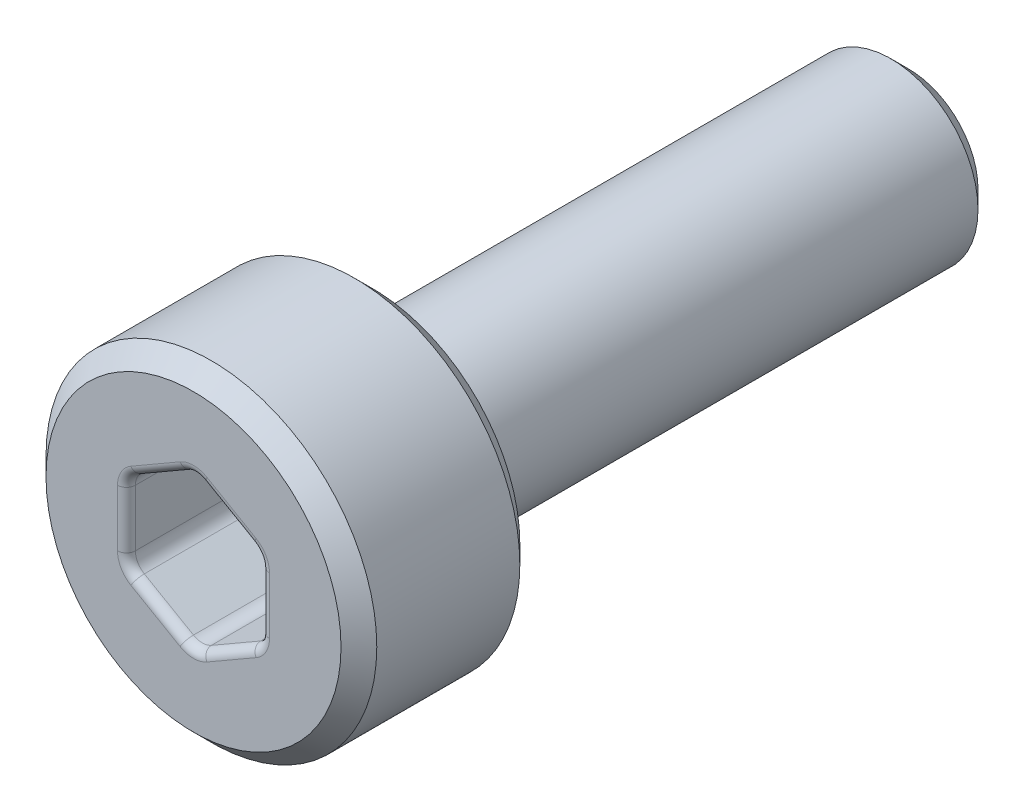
ISO-10303-21;
HEADER;
FILE_DESCRIPTION(('STEP AP214'),'2;1');
FILE_NAME('part.step','',(''),(''),'','','');
FILE_SCHEMA(('AUTOMOTIVE_DESIGN { 1 0 10303 214 1 1 1 1 }'));
ENDSEC;
DATA;
#1=APPLICATION_CONTEXT('core data for automotive mechanical design processes');
#2=APPLICATION_PROTOCOL_DEFINITION('international standard','automotive_design',2000,#1);
#3=PRODUCT_CONTEXT('',#1,'mechanical');
#4=PRODUCT('Part','Part','',(#3));
#5=PRODUCT_RELATED_PRODUCT_CATEGORY('part','',(#4));
#6=PRODUCT_DEFINITION_FORMATION('','',#4);
#7=PRODUCT_DEFINITION_CONTEXT('part definition',#1,'design');
#8=PRODUCT_DEFINITION('design','',#6,#7);
#9=PRODUCT_DEFINITION_SHAPE('','',#8);
#10=(LENGTH_UNIT() NAMED_UNIT(*) SI_UNIT(.MILLI.,.METRE.));
#11=(NAMED_UNIT(*) PLANE_ANGLE_UNIT() SI_UNIT($,.RADIAN.));
#12=(NAMED_UNIT(*) SI_UNIT($,.STERADIAN.) SOLID_ANGLE_UNIT());
#13=UNCERTAINTY_MEASURE_WITH_UNIT(LENGTH_MEASURE(1.E-05),#10,'distance_accuracy_value','');
#14=(GEOMETRIC_REPRESENTATION_CONTEXT(3) GLOBAL_UNCERTAINTY_ASSIGNED_CONTEXT((#13)) GLOBAL_UNIT_ASSIGNED_CONTEXT((#10,
#11,#12)) REPRESENTATION_CONTEXT('',''));
#15=CARTESIAN_POINT('',(0.,0.,0.));
#16=DIRECTION('',(0.,0.,1.));
#17=DIRECTION('',(1.,0.,0.));
#18=AXIS2_PLACEMENT_3D('',#15,#16,#17);
#19=CARTESIAN_POINT('',(0.,0.,2.));
#20=DIRECTION('',(0.,0.,-1.));
#21=DIRECTION('',(-1.,0.,0.));
#22=AXIS2_PLACEMENT_3D('',#19,#20,#21);
#23=PLANE('',#22);
#24=DIRECTION('',(0.,1.,0.));
#25=VECTOR('',#24,1.);
#26=CARTESIAN_POINT('',(0.85,0.,2.));
#27=LINE('',#26,#25);
#28=CARTESIAN_POINT('',(0.85,0.317542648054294,2.));
#29=VERTEX_POINT('',#28);
#30=CARTESIAN_POINT('',(0.85,-0.317542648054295,2.));
#31=VERTEX_POINT('',#30);
#32=EDGE_CURVE('E264',#29,#31,#27,.F.);
#33=ORIENTED_EDGE('',*,*,#32,.T.);
#34=CARTESIAN_POINT('',(0.55,-0.317542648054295,2.));
#35=DIRECTION('',(0.,0.,-1.));
#36=DIRECTION('',(-1.,0.,0.));
#37=AXIS2_PLACEMENT_3D('',#34,#35,#36);
#38=CIRCLE('',#37,0.3);
#39=CARTESIAN_POINT('',(0.699999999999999,-0.577350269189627,2.));
#40=VERTEX_POINT('',#39);
#41=EDGE_CURVE('E329',#31,#40,#38,.T.);
#42=ORIENTED_EDGE('',*,*,#41,.T.);
#43=DIRECTION('',(0.866025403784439,0.499999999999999,0.));
#44=VECTOR('',#43,1.);
#45=CARTESIAN_POINT('',(0.424999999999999,-0.736121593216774,2.));
#46=LINE('',#45,#44);
#47=CARTESIAN_POINT('',(0.149999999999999,-0.89489291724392,2.));
#48=VERTEX_POINT('',#47);
#49=EDGE_CURVE('E327',#40,#48,#46,.F.);
#50=ORIENTED_EDGE('',*,*,#49,.T.);
#51=CARTESIAN_POINT('',(0.,-0.635085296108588,2.));
#52=DIRECTION('',(0.,0.,-1.));
#53=DIRECTION('',(-1.,0.,0.));
#54=AXIS2_PLACEMENT_3D('',#51,#52,#53);
#55=CIRCLE('',#54,0.3);
#56=CARTESIAN_POINT('',(-0.150000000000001,-0.89489291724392,2.));
#57=VERTEX_POINT('',#56);
#58=EDGE_CURVE('E325',#48,#57,#55,.T.);
#59=ORIENTED_EDGE('',*,*,#58,.T.);
#60=DIRECTION('',(0.866025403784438,-0.500000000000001,0.));
#61=VECTOR('',#60,1.);
#62=CARTESIAN_POINT('',(-0.425000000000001,-0.736121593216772,2.));
#63=LINE('',#62,#61);
#64=CARTESIAN_POINT('',(-0.700000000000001,-0.577350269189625,2.));
#65=VERTEX_POINT('',#64);
#66=EDGE_CURVE('E323',#57,#65,#63,.F.);
#67=ORIENTED_EDGE('',*,*,#66,.T.);
#68=CARTESIAN_POINT('',(-0.550000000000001,-0.317542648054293,2.));
#69=DIRECTION('',(0.,0.,-1.));
#70=DIRECTION('',(-1.,0.,0.));
#71=AXIS2_PLACEMENT_3D('',#68,#69,#70);
#72=CIRCLE('',#71,0.3);
#73=CARTESIAN_POINT('',(-0.850000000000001,-0.317542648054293,2.));
#74=VERTEX_POINT('',#73);
#75=EDGE_CURVE('E321',#65,#74,#72,.T.);
#76=ORIENTED_EDGE('',*,*,#75,.T.);
#77=DIRECTION('',(0.,-1.,0.));
#78=VECTOR('',#77,1.);
#79=CARTESIAN_POINT('',(-0.85,0.,2.));
#80=LINE('',#79,#78);
#81=CARTESIAN_POINT('',(-0.85,0.317542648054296,2.));
#82=VERTEX_POINT('',#81);
#83=EDGE_CURVE('E319',#74,#82,#80,.F.);
#84=ORIENTED_EDGE('',*,*,#83,.T.);
#85=CARTESIAN_POINT('',(-0.55,0.317542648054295,2.));
#86=DIRECTION('',(0.,0.,-1.));
#87=DIRECTION('',(-1.,0.,0.));
#88=AXIS2_PLACEMENT_3D('',#85,#86,#87);
#89=CIRCLE('',#88,0.3);
#90=CARTESIAN_POINT('',(-0.699999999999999,0.577350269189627,2.));
#91=VERTEX_POINT('',#90);
#92=EDGE_CURVE('E317',#82,#91,#89,.T.);
#93=ORIENTED_EDGE('',*,*,#92,.T.);
#94=DIRECTION('',(-0.866025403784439,-0.499999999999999,0.));
#95=VECTOR('',#94,1.);
#96=CARTESIAN_POINT('',(-0.424999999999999,0.736121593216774,2.));
#97=LINE('',#96,#95);
#98=CARTESIAN_POINT('',(-0.149999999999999,0.894892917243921,2.));
#99=VERTEX_POINT('',#98);
#100=EDGE_CURVE('E315',#91,#99,#97,.F.);
#101=ORIENTED_EDGE('',*,*,#100,.T.);
#102=CARTESIAN_POINT('',(0.,0.635085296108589,2.));
#103=DIRECTION('',(0.,0.,-1.));
#104=DIRECTION('',(-1.,0.,0.));
#105=AXIS2_PLACEMENT_3D('',#102,#103,#104);
#106=CIRCLE('',#105,0.3);
#107=CARTESIAN_POINT('',(0.150000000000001,0.89489291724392,2.));
#108=VERTEX_POINT('',#107);
#109=EDGE_CURVE('E313',#99,#108,#106,.T.);
#110=ORIENTED_EDGE('',*,*,#109,.T.);
#111=DIRECTION('',(-0.866025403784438,0.500000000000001,0.));
#112=VECTOR('',#111,1.);
#113=CARTESIAN_POINT('',(0.425000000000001,0.736121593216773,2.));
#114=LINE('',#113,#112);
#115=CARTESIAN_POINT('',(0.700000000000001,0.577350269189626,2.));
#116=VERTEX_POINT('',#115);
#117=EDGE_CURVE('E311',#108,#116,#114,.F.);
#118=ORIENTED_EDGE('',*,*,#117,.T.);
#119=CARTESIAN_POINT('',(0.55,0.317542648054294,2.));
#120=DIRECTION('',(0.,0.,-1.));
#121=DIRECTION('',(-1.,0.,0.));
#122=AXIS2_PLACEMENT_3D('',#119,#120,#121);
#123=CIRCLE('',#122,0.3);
#124=EDGE_CURVE('E309',#116,#29,#123,.T.);
#125=ORIENTED_EDGE('',*,*,#124,.T.);
#126=EDGE_LOOP('',(#33,#42,#50,#59,#67,#76,#84,#93,#101,#110,#118,#125));
#127=FACE_BOUND('',#126,.T.);
#128=CARTESIAN_POINT('',(0.,0.,2.));
#129=DIRECTION('',(0.,0.,-1.));
#130=DIRECTION('',(-1.,0.,0.));
#131=AXIS2_PLACEMENT_3D('',#128,#129,#130);
#132=CIRCLE('',#131,1.65);
#133=CARTESIAN_POINT('',(-1.65,0.,2.));
#134=VERTEX_POINT('',#133);
#135=EDGE_CURVE('E307',#134,#134,#132,.F.);
#136=ORIENTED_EDGE('',*,*,#135,.T.);
#137=EDGE_LOOP('',(#136));
#138=FACE_BOUND('',#137,.T.);
#139=ADVANCED_FACE('F35',(#127,#138),#23,.F.);
#140=CARTESIAN_POINT('',(0.,0.,21.9198795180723));
#141=DIRECTION('',(0.,0.,1.));
#142=DIRECTION('',(1.,0.,0.));
#143=AXIS2_PLACEMENT_3D('',#140,#141,#142);
#144=CYLINDRICAL_SURFACE('',#143,1.85);
#145=CARTESIAN_POINT('',(0.,0.,1.8));
#146=DIRECTION('',(0.,0.,-1.));
#147=DIRECTION('',(-1.,0.,0.));
#148=AXIS2_PLACEMENT_3D('',#145,#146,#147);
#149=CIRCLE('',#148,1.85);
#150=CARTESIAN_POINT('',(-1.85,0.,1.8));
#151=VERTEX_POINT('',#150);
#152=EDGE_CURVE('E869',#151,#151,#149,.T.);
#153=ORIENTED_EDGE('',*,*,#152,.T.);
#154=EDGE_LOOP('',(#153));
#155=FACE_BOUND('',#154,.T.);
#156=CARTESIAN_POINT('',(0.,0.,0.200000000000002));
#157=DIRECTION('',(0.,0.,1.));
#158=DIRECTION('',(1.,0.,0.));
#159=AXIS2_PLACEMENT_3D('',#156,#157,#158);
#160=CIRCLE('',#159,1.85);
#161=CARTESIAN_POINT('',(1.85,0.,0.200000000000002));
#162=VERTEX_POINT('',#161);
#163=EDGE_CURVE('E874',#162,#162,#160,.T.);
#164=ORIENTED_EDGE('',*,*,#163,.T.);
#165=EDGE_LOOP('',(#164));
#166=FACE_BOUND('',#165,.T.);
#167=ADVANCED_FACE('F428',(#155,#166),#144,.T.);
#168=CARTESIAN_POINT('',(0.,1.85,0.));
#169=DIRECTION('',(0.,0.,1.));
#170=DIRECTION('',(1.,0.,0.));
#171=AXIS2_PLACEMENT_3D('',#168,#169,#170);
#172=PLANE('',#171);
#173=CARTESIAN_POINT('',(0.,0.,0.));
#174=DIRECTION('',(0.,0.,1.));
#175=DIRECTION('',(1.,0.,0.));
#176=AXIS2_PLACEMENT_3D('',#173,#174,#175);
#177=CIRCLE('',#176,1.175);
#178=CARTESIAN_POINT('',(1.175,0.,0.));
#179=VERTEX_POINT('',#178);
#180=EDGE_CURVE('E259',#179,#179,#177,.T.);
#181=ORIENTED_EDGE('',*,*,#180,.T.);
#182=EDGE_LOOP('',(#181));
#183=FACE_BOUND('',#182,.T.);
#184=CARTESIAN_POINT('',(0.,0.,0.));
#185=DIRECTION('',(0.,0.,1.));
#186=DIRECTION('',(1.,0.,0.));
#187=AXIS2_PLACEMENT_3D('',#184,#185,#186);
#188=CIRCLE('',#187,1.65);
#189=CARTESIAN_POINT('',(1.65,0.,0.));
#190=VERTEX_POINT('',#189);
#191=EDGE_CURVE('E867',#190,#190,#188,.F.);
#192=ORIENTED_EDGE('',*,*,#191,.T.);
#193=EDGE_LOOP('',(#192));
#194=FACE_BOUND('',#193,.T.);
#195=ADVANCED_FACE('F434',(#183,#194),#172,.F.);
#196=CARTESIAN_POINT('',(0.,0.,21.9198795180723));
#197=DIRECTION('',(0.,0.,1.));
#198=DIRECTION('',(1.,0.,0.));
#199=AXIS2_PLACEMENT_3D('',#196,#197,#198);
#200=CYLINDRICAL_SURFACE('',#199,0.975);
#201=CARTESIAN_POINT('',(0.,0.,-0.200000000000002));
#202=DIRECTION('',(0.,0.,1.));
#203=DIRECTION('',(1.,0.,0.));
#204=AXIS2_PLACEMENT_3D('',#201,#202,#203);
#205=CIRCLE('',#204,0.975);
#206=CARTESIAN_POINT('',(0.975,0.,-0.200000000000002));
#207=VERTEX_POINT('',#206);
#208=EDGE_CURVE('E262',#207,#207,#205,.F.);
#209=ORIENTED_EDGE('',*,*,#208,.T.);
#210=EDGE_LOOP('',(#209));
#211=FACE_BOUND('',#210,.T.);
#212=CARTESIAN_POINT('',(0.,0.,-5.80000000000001));
#213=DIRECTION('',(0.,0.,1.));
#214=DIRECTION('',(1.,0.,0.));
#215=AXIS2_PLACEMENT_3D('',#212,#213,#214);
#216=CIRCLE('',#215,0.975);
#217=CARTESIAN_POINT('',(0.975,0.,-5.80000000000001));
#218=VERTEX_POINT('',#217);
#219=EDGE_CURVE('E868',#218,#218,#216,.T.);
#220=ORIENTED_EDGE('',*,*,#219,.T.);
#221=EDGE_LOOP('',(#220));
#222=FACE_BOUND('',#221,.T.);
#223=ADVANCED_FACE('F809',(#211,#222),#200,.T.);
#224=CARTESIAN_POINT('',(0.,0.975,-6.));
#225=DIRECTION('',(0.,0.,1.));
#226=DIRECTION('',(1.,0.,0.));
#227=AXIS2_PLACEMENT_3D('',#224,#225,#226);
#228=PLANE('',#227);
#229=CARTESIAN_POINT('',(0.,0.,-6.));
#230=DIRECTION('',(0.,0.,1.));
#231=DIRECTION('',(1.,0.,0.));
#232=AXIS2_PLACEMENT_3D('',#229,#230,#231);
#233=CIRCLE('',#232,0.775000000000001);
#234=CARTESIAN_POINT('',(0.775000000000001,0.,-6.));
#235=VERTEX_POINT('',#234);
#236=EDGE_CURVE('E209',#235,#235,#233,.F.);
#237=ORIENTED_EDGE('',*,*,#236,.T.);
#238=EDGE_LOOP('',(#237));
#239=FACE_BOUND('',#238,.T.);
#240=ADVANCED_FACE('F801',(#239),#228,.F.);
#241=CARTESIAN_POINT('',(0.,-0.866025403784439,0.499999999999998));
#242=DIRECTION('',(0.499999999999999,-0.866025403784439,0.));
#243=DIRECTION('',(0.866025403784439,0.499999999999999,0.));
#244=AXIS2_PLACEMENT_3D('',#241,#242,#243);
#245=PLANE('',#244);
#246=DIRECTION('',(0.,0.,1.));
#247=VECTOR('',#246,1.);
#248=CARTESIAN_POINT('',(0.0999999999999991,-0.808290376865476,2.));
#249=LINE('',#248,#247);
#250=CARTESIAN_POINT('',(0.0999999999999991,-0.808290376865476,0.699999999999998));
#251=VERTEX_POINT('',#250);
#252=CARTESIAN_POINT('',(0.0999999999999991,-0.808290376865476,1.9));
#253=VERTEX_POINT('',#252);
#254=EDGE_CURVE('E256',#251,#253,#249,.T.);
#255=ORIENTED_EDGE('',*,*,#254,.T.);
#256=DIRECTION('',(0.866025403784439,0.499999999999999,0.));
#257=VECTOR('',#256,1.);
#258=CARTESIAN_POINT('',(0.,-0.866025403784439,1.9));
#259=LINE('',#258,#257);
#260=CARTESIAN_POINT('',(0.649999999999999,-0.490747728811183,1.9));
#261=VERTEX_POINT('',#260);
#262=EDGE_CURVE('E335',#253,#261,#259,.T.);
#263=ORIENTED_EDGE('',*,*,#262,.T.);
#264=DIRECTION('',(0.,0.,1.));
#265=VECTOR('',#264,1.);
#266=CARTESIAN_POINT('',(0.649999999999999,-0.490747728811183,0.499999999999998));
#267=LINE('',#266,#265);
#268=CARTESIAN_POINT('',(0.649999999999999,-0.490747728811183,0.699999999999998));
#269=VERTEX_POINT('',#268);
#270=EDGE_CURVE('E252',#261,#269,#267,.F.);
#271=ORIENTED_EDGE('',*,*,#270,.T.);
#272=DIRECTION('',(0.866025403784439,0.499999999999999,0.));
#273=VECTOR('',#272,1.);
#274=CARTESIAN_POINT('',(0.,-0.866025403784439,0.699999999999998));
#275=LINE('',#274,#273);
#276=EDGE_CURVE('E254',#269,#251,#275,.F.);
#277=ORIENTED_EDGE('',*,*,#276,.T.);
#278=EDGE_LOOP('',(#255,#263,#271,#277));
#279=FACE_BOUND('',#278,.T.);
#280=ADVANCED_FACE('F792',(#279),#245,.F.);
#281=CARTESIAN_POINT('',(-0.750000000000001,-0.433012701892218,0.499999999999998));
#282=DIRECTION('',(-0.500000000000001,-0.866025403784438,0.));
#283=DIRECTION('',(0.866025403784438,-0.500000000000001,0.));
#284=AXIS2_PLACEMENT_3D('',#281,#282,#283);
#285=PLANE('',#284);
#286=DIRECTION('',(0.,0.,1.));
#287=VECTOR('',#286,1.);
#288=CARTESIAN_POINT('',(-0.650000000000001,-0.490747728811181,2.));
#289=LINE('',#288,#287);
#290=CARTESIAN_POINT('',(-0.650000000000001,-0.490747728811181,0.699999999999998));
#291=VERTEX_POINT('',#290);
#292=CARTESIAN_POINT('',(-0.650000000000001,-0.490747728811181,1.9));
#293=VERTEX_POINT('',#292);
#294=EDGE_CURVE('E223',#291,#293,#289,.T.);
#295=ORIENTED_EDGE('',*,*,#294,.T.);
#296=DIRECTION('',(0.866025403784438,-0.500000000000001,0.));
#297=VECTOR('',#296,1.);
#298=CARTESIAN_POINT('',(-0.750000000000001,-0.433012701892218,1.9));
#299=LINE('',#298,#297);
#300=CARTESIAN_POINT('',(-0.100000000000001,-0.808290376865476,1.9));
#301=VERTEX_POINT('',#300);
#302=EDGE_CURVE('E339',#293,#301,#299,.T.);
#303=ORIENTED_EDGE('',*,*,#302,.T.);
#304=DIRECTION('',(0.,0.,1.));
#305=VECTOR('',#304,1.);
#306=CARTESIAN_POINT('',(-0.100000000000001,-0.808290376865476,0.499999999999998));
#307=LINE('',#306,#305);
#308=CARTESIAN_POINT('',(-0.100000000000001,-0.808290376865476,0.699999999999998));
#309=VERTEX_POINT('',#308);
#310=EDGE_CURVE('E215',#301,#309,#307,.F.);
#311=ORIENTED_EDGE('',*,*,#310,.T.);
#312=DIRECTION('',(0.866025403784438,-0.500000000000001,0.));
#313=VECTOR('',#312,1.);
#314=CARTESIAN_POINT('',(-0.750000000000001,-0.433012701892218,0.699999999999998));
#315=LINE('',#314,#313);
#316=EDGE_CURVE('E186',#309,#291,#315,.F.);
#317=ORIENTED_EDGE('',*,*,#316,.T.);
#318=EDGE_LOOP('',(#295,#303,#311,#317));
#319=FACE_BOUND('',#318,.T.);
#320=ADVANCED_FACE('F784',(#319),#285,.F.);
#321=CARTESIAN_POINT('',(-0.75,0.433012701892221,0.499999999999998));
#322=DIRECTION('',(-1.,0.,0.));
#323=DIRECTION('',(0.,-1.,0.));
#324=AXIS2_PLACEMENT_3D('',#321,#322,#323);
#325=PLANE('',#324);
#326=DIRECTION('',(0.,0.,1.));
#327=VECTOR('',#326,1.);
#328=CARTESIAN_POINT('',(-0.75,0.317542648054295,2.));
#329=LINE('',#328,#327);
#330=CARTESIAN_POINT('',(-0.75,0.317542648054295,0.699999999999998));
#331=VERTEX_POINT('',#330);
#332=CARTESIAN_POINT('',(-0.75,0.317542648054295,1.9));
#333=VERTEX_POINT('',#332);
#334=EDGE_CURVE('E226',#331,#333,#329,.T.);
#335=ORIENTED_EDGE('',*,*,#334,.T.);
#336=DIRECTION('',(0.,-1.,0.));
#337=VECTOR('',#336,1.);
#338=CARTESIAN_POINT('',(-0.75,0.433012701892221,1.9));
#339=LINE('',#338,#337);
#340=CARTESIAN_POINT('',(-0.750000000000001,-0.317542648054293,1.9));
#341=VERTEX_POINT('',#340);
#342=EDGE_CURVE('E343',#333,#341,#339,.T.);
#343=ORIENTED_EDGE('',*,*,#342,.T.);
#344=DIRECTION('',(0.,0.,1.));
#345=VECTOR('',#344,1.);
#346=CARTESIAN_POINT('',(-0.750000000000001,-0.317542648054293,0.499999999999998));
#347=LINE('',#346,#345);
#348=CARTESIAN_POINT('',(-0.750000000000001,-0.317542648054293,0.699999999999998));
#349=VERTEX_POINT('',#348);
#350=EDGE_CURVE('E231',#341,#349,#347,.F.);
#351=ORIENTED_EDGE('',*,*,#350,.T.);
#352=DIRECTION('',(0.,-1.,0.));
#353=VECTOR('',#352,1.);
#354=CARTESIAN_POINT('',(-0.75,0.433012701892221,0.699999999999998));
#355=LINE('',#354,#353);
#356=EDGE_CURVE('E229',#349,#331,#355,.F.);
#357=ORIENTED_EDGE('',*,*,#356,.T.);
#358=EDGE_LOOP('',(#335,#343,#351,#357));
#359=FACE_BOUND('',#358,.T.);
#360=ADVANCED_FACE('F403',(#359),#325,.F.);
#361=CARTESIAN_POINT('',(0.,0.866025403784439,0.499999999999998));
#362=DIRECTION('',(-0.499999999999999,0.866025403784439,0.));
#363=DIRECTION('',(-0.866025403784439,-0.499999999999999,0.));
#364=AXIS2_PLACEMENT_3D('',#361,#362,#363);
#365=PLANE('',#364);
#366=DIRECTION('',(0.,0.,1.));
#367=VECTOR('',#366,1.);
#368=CARTESIAN_POINT('',(-0.0999999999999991,0.808290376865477,2.));
#369=LINE('',#368,#367);
#370=CARTESIAN_POINT('',(-0.0999999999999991,0.808290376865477,0.699999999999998));
#371=VERTEX_POINT('',#370);
#372=CARTESIAN_POINT('',(-0.0999999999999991,0.808290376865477,1.9));
#373=VERTEX_POINT('',#372);
#374=EDGE_CURVE('E237',#371,#373,#369,.T.);
#375=ORIENTED_EDGE('',*,*,#374,.T.);
#376=DIRECTION('',(-0.866025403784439,-0.499999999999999,0.));
#377=VECTOR('',#376,1.);
#378=CARTESIAN_POINT('',(0.,0.866025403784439,1.9));
#379=LINE('',#378,#377);
#380=CARTESIAN_POINT('',(-0.65,0.490747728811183,1.9));
#381=VERTEX_POINT('',#380);
#382=EDGE_CURVE('E347',#373,#381,#379,.T.);
#383=ORIENTED_EDGE('',*,*,#382,.T.);
#384=DIRECTION('',(0.,0.,1.));
#385=VECTOR('',#384,1.);
#386=CARTESIAN_POINT('',(-0.65,0.490747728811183,0.499999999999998));
#387=LINE('',#386,#385);
#388=CARTESIAN_POINT('',(-0.65,0.490747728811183,0.699999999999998));
#389=VERTEX_POINT('',#388);
#390=EDGE_CURVE('E233',#381,#389,#387,.F.);
#391=ORIENTED_EDGE('',*,*,#390,.T.);
#392=DIRECTION('',(-0.866025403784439,-0.499999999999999,0.));
#393=VECTOR('',#392,1.);
#394=CARTESIAN_POINT('',(0.,0.866025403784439,0.699999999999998));
#395=LINE('',#394,#393);
#396=EDGE_CURVE('E235',#389,#371,#395,.F.);
#397=ORIENTED_EDGE('',*,*,#396,.T.);
#398=EDGE_LOOP('',(#375,#383,#391,#397));
#399=FACE_BOUND('',#398,.T.);
#400=ADVANCED_FACE('F767',(#399),#365,.F.);
#401=CARTESIAN_POINT('',(0.75,0.433012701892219,0.499999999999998));
#402=DIRECTION('',(0.500000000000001,0.866025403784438,0.));
#403=DIRECTION('',(-0.866025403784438,0.500000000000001,0.));
#404=AXIS2_PLACEMENT_3D('',#401,#402,#403);
#405=PLANE('',#404);
#406=DIRECTION('',(0.,0.,1.));
#407=VECTOR('',#406,1.);
#408=CARTESIAN_POINT('',(0.65,0.490747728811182,2.));
#409=LINE('',#408,#407);
#410=CARTESIAN_POINT('',(0.65,0.490747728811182,0.699999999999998));
#411=VERTEX_POINT('',#410);
#412=CARTESIAN_POINT('',(0.65,0.490747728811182,1.9));
#413=VERTEX_POINT('',#412);
#414=EDGE_CURVE('E244',#411,#413,#409,.T.);
#415=ORIENTED_EDGE('',*,*,#414,.T.);
#416=DIRECTION('',(-0.866025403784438,0.500000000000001,0.));
#417=VECTOR('',#416,1.);
#418=CARTESIAN_POINT('',(0.75,0.433012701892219,1.9));
#419=LINE('',#418,#417);
#420=CARTESIAN_POINT('',(0.100000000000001,0.808290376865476,1.9));
#421=VERTEX_POINT('',#420);
#422=EDGE_CURVE('E351',#413,#421,#419,.T.);
#423=ORIENTED_EDGE('',*,*,#422,.T.);
#424=DIRECTION('',(0.,0.,1.));
#425=VECTOR('',#424,1.);
#426=CARTESIAN_POINT('',(0.100000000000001,0.808290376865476,0.499999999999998));
#427=LINE('',#426,#425);
#428=CARTESIAN_POINT('',(0.100000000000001,0.808290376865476,0.699999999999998));
#429=VERTEX_POINT('',#428);
#430=EDGE_CURVE('E240',#421,#429,#427,.F.);
#431=ORIENTED_EDGE('',*,*,#430,.T.);
#432=DIRECTION('',(-0.866025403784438,0.500000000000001,0.));
#433=VECTOR('',#432,1.);
#434=CARTESIAN_POINT('',(0.75,0.433012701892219,0.699999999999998));
#435=LINE('',#434,#433);
#436=EDGE_CURVE('E242',#429,#411,#435,.F.);
#437=ORIENTED_EDGE('',*,*,#436,.T.);
#438=EDGE_LOOP('',(#415,#423,#431,#437));
#439=FACE_BOUND('',#438,.T.);
#440=ADVANCED_FACE('F759',(#439),#405,.F.);
#441=CARTESIAN_POINT('',(0.75,-0.433012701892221,0.499999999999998));
#442=DIRECTION('',(1.,0.,0.));
#443=DIRECTION('',(0.,1.,0.));
#444=AXIS2_PLACEMENT_3D('',#441,#442,#443);
#445=PLANE('',#444);
#446=DIRECTION('',(0.,0.,1.));
#447=VECTOR('',#446,1.);
#448=CARTESIAN_POINT('',(0.75,-0.317542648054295,2.));
#449=LINE('',#448,#447);
#450=CARTESIAN_POINT('',(0.75,-0.317542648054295,0.699999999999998));
#451=VERTEX_POINT('',#450);
#452=CARTESIAN_POINT('',(0.75,-0.317542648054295,1.9));
#453=VERTEX_POINT('',#452);
#454=EDGE_CURVE('E250',#451,#453,#449,.T.);
#455=ORIENTED_EDGE('',*,*,#454,.T.);
#456=DIRECTION('',(0.,1.,0.));
#457=VECTOR('',#456,1.);
#458=CARTESIAN_POINT('',(0.75,-0.433012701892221,1.9));
#459=LINE('',#458,#457);
#460=CARTESIAN_POINT('',(0.75,0.317542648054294,1.9));
#461=VERTEX_POINT('',#460);
#462=EDGE_CURVE('E11',#453,#461,#459,.T.);
#463=ORIENTED_EDGE('',*,*,#462,.T.);
#464=DIRECTION('',(0.,0.,1.));
#465=VECTOR('',#464,1.);
#466=CARTESIAN_POINT('',(0.75,0.317542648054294,0.499999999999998));
#467=LINE('',#466,#465);
#468=CARTESIAN_POINT('',(0.75,0.317542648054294,0.699999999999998));
#469=VERTEX_POINT('',#468);
#470=EDGE_CURVE('E246',#461,#469,#467,.F.);
#471=ORIENTED_EDGE('',*,*,#470,.T.);
#472=DIRECTION('',(0.,1.,0.));
#473=VECTOR('',#472,1.);
#474=CARTESIAN_POINT('',(0.75,-0.433012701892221,0.699999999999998));
#475=LINE('',#474,#473);
#476=EDGE_CURVE('E248',#469,#451,#475,.F.);
#477=ORIENTED_EDGE('',*,*,#476,.T.);
#478=EDGE_LOOP('',(#455,#463,#471,#477));
#479=FACE_BOUND('',#478,.T.);
#480=ADVANCED_FACE('F751',(#479),#445,.F.);
#481=CARTESIAN_POINT('',(0.,0.,0.499999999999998));
#482=DIRECTION('',(0.,0.,1.));
#483=DIRECTION('',(1.,0.,0.));
#484=AXIS2_PLACEMENT_3D('',#481,#482,#483);
#485=PLANE('',#484);
#486=DIRECTION('',(0.,-1.,0.));
#487=VECTOR('',#486,1.);
#488=CARTESIAN_POINT('',(-0.55,0.,0.499999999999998));
#489=LINE('',#488,#487);
#490=CARTESIAN_POINT('',(-0.55,0.317542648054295,0.499999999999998));
#491=VERTEX_POINT('',#490);
#492=CARTESIAN_POINT('',(-0.550000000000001,-0.317542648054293,0.499999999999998));
#493=VERTEX_POINT('',#492);
#494=EDGE_CURVE('E213',#491,#493,#489,.T.);
#495=ORIENTED_EDGE('',*,*,#494,.T.);
#496=DIRECTION('',(0.866025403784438,-0.500000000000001,0.));
#497=VECTOR('',#496,1.);
#498=CARTESIAN_POINT('',(-0.275000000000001,-0.476313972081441,0.499999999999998));
#499=LINE('',#498,#497);
#500=CARTESIAN_POINT('',(0.,-0.635085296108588,0.499999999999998));
#501=VERTEX_POINT('',#500);
#502=EDGE_CURVE('E184',#493,#501,#499,.T.);
#503=ORIENTED_EDGE('',*,*,#502,.T.);
#504=DIRECTION('',(0.866025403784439,0.499999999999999,0.));
#505=VECTOR('',#504,1.);
#506=CARTESIAN_POINT('',(0.274999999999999,-0.476313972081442,0.499999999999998));
#507=LINE('',#506,#505);
#508=CARTESIAN_POINT('',(0.55,-0.317542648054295,0.499999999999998));
#509=VERTEX_POINT('',#508);
#510=EDGE_CURVE('E202',#501,#509,#507,.T.);
#511=ORIENTED_EDGE('',*,*,#510,.T.);
#512=DIRECTION('',(0.,1.,0.));
#513=VECTOR('',#512,1.);
#514=CARTESIAN_POINT('',(0.55,0.,0.499999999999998));
#515=LINE('',#514,#513);
#516=CARTESIAN_POINT('',(0.55,0.317542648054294,0.499999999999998));
#517=VERTEX_POINT('',#516);
#518=EDGE_CURVE('E208',#509,#517,#515,.T.);
#519=ORIENTED_EDGE('',*,*,#518,.T.);
#520=DIRECTION('',(-0.866025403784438,0.500000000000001,0.));
#521=VECTOR('',#520,1.);
#522=CARTESIAN_POINT('',(0.275000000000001,0.476313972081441,0.499999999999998));
#523=LINE('',#522,#521);
#524=CARTESIAN_POINT('',(0.,0.635085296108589,0.499999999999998));
#525=VERTEX_POINT('',#524);
#526=EDGE_CURVE('E881',#517,#525,#523,.T.);
#527=ORIENTED_EDGE('',*,*,#526,.T.);
#528=DIRECTION('',(-0.866025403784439,-0.499999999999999,0.));
#529=VECTOR('',#528,1.);
#530=CARTESIAN_POINT('',(-0.275,0.476313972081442,0.499999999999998));
#531=LINE('',#530,#529);
#532=EDGE_CURVE('E218',#525,#491,#531,.T.);
#533=ORIENTED_EDGE('',*,*,#532,.T.);
#534=EDGE_LOOP('',(#495,#503,#511,#519,#527,#533));
#535=FACE_BOUND('',#534,.T.);
#536=ADVANCED_FACE('F211',(#535),#485,.T.);
#537=CARTESIAN_POINT('',(0.,0.,2.));
#538=DIRECTION('',(0.,0.,-1.));
#539=DIRECTION('',(-1.,0.,0.));
#540=AXIS2_PLACEMENT_3D('',#537,#538,#539);
#541=CONICAL_SURFACE('',#540,1.65,0.785398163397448);
#542=ORIENTED_EDGE('',*,*,#152,.F.);
#543=EDGE_LOOP('',(#542));
#544=FACE_BOUND('',#543,.T.);
#545=ORIENTED_EDGE('',*,*,#135,.F.);
#546=EDGE_LOOP('',(#545));
#547=FACE_BOUND('',#546,.T.);
#548=ADVANCED_FACE('F440',(#544,#547),#541,.T.);
#549=CARTESIAN_POINT('',(0.,0.,0.200000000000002));
#550=DIRECTION('',(0.,0.,1.));
#551=DIRECTION('',(1.,0.,0.));
#552=AXIS2_PLACEMENT_3D('',#549,#550,#551);
#553=CONICAL_SURFACE('',#552,1.85,0.78539816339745);
#554=ORIENTED_EDGE('',*,*,#191,.F.);
#555=EDGE_LOOP('',(#554));
#556=FACE_BOUND('',#555,.T.);
#557=ORIENTED_EDGE('',*,*,#163,.F.);
#558=EDGE_LOOP('',(#557));
#559=FACE_BOUND('',#558,.T.);
#560=ADVANCED_FACE('F443',(#556,#559),#553,.T.);
#561=CARTESIAN_POINT('',(0.,0.,-5.80000000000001));
#562=DIRECTION('',(0.,0.,1.));
#563=DIRECTION('',(1.,0.,0.));
#564=AXIS2_PLACEMENT_3D('',#561,#562,#563);
#565=CONICAL_SURFACE('',#564,0.975,0.785398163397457);
#566=ORIENTED_EDGE('',*,*,#236,.F.);
#567=EDGE_LOOP('',(#566));
#568=FACE_BOUND('',#567,.T.);
#569=ORIENTED_EDGE('',*,*,#219,.F.);
#570=EDGE_LOOP('',(#569));
#571=FACE_BOUND('',#570,.T.);
#572=ADVANCED_FACE('F447',(#568,#571),#565,.T.);
#573=CARTESIAN_POINT('',(0.,0.635085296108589,0.499999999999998));
#574=DIRECTION('',(0.,0.,-1.));
#575=DIRECTION('',(-1.,0.,0.));
#576=AXIS2_PLACEMENT_3D('',#573,#574,#575);
#577=CYLINDRICAL_SURFACE('',#576,0.2);
#578=ORIENTED_EDGE('',*,*,#430,.F.);
#579=CARTESIAN_POINT('',(0.,0.635085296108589,1.9));
#580=DIRECTION('',(0.,0.,-1.));
#581=DIRECTION('',(-1.,0.,0.));
#582=AXIS2_PLACEMENT_3D('',#579,#580,#581);
#583=CIRCLE('',#582,0.2);
#584=EDGE_CURVE('E349',#421,#373,#583,.F.);
#585=ORIENTED_EDGE('',*,*,#584,.T.);
#586=ORIENTED_EDGE('',*,*,#374,.F.);
#587=CARTESIAN_POINT('',(0.,0.635085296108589,0.699999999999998));
#588=DIRECTION('',(0.,0.,1.));
#589=DIRECTION('',(1.,0.,0.));
#590=AXIS2_PLACEMENT_3D('',#587,#588,#589);
#591=CIRCLE('',#590,0.2);
#592=EDGE_CURVE('E304',#429,#371,#591,.T.);
#593=ORIENTED_EDGE('',*,*,#592,.F.);
#594=EDGE_LOOP('',(#578,#585,#586,#593));
#595=FACE_BOUND('',#594,.T.);
#596=ADVANCED_FACE('F451',(#595),#577,.F.);
#597=CARTESIAN_POINT('',(0.275000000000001,0.476313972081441,0.699999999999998));
#598=DIRECTION('',(-0.866025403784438,0.500000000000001,0.));
#599=DIRECTION('',(-0.500000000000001,-0.866025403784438,0.));
#600=AXIS2_PLACEMENT_3D('',#597,#598,#599);
#601=CYLINDRICAL_SURFACE('',#600,0.2);
#602=CARTESIAN_POINT('',(0.55,0.317542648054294,0.699999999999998));
#603=DIRECTION('',(-0.866025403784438,0.500000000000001,0.));
#604=DIRECTION('',(-0.500000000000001,-0.866025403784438,0.));
#605=AXIS2_PLACEMENT_3D('',#602,#603,#604);
#606=CIRCLE('',#605,0.2);
#607=EDGE_CURVE('E298',#411,#517,#606,.T.);
#608=ORIENTED_EDGE('',*,*,#607,.F.);
#609=ORIENTED_EDGE('',*,*,#436,.F.);
#610=CARTESIAN_POINT('',(0.,0.635085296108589,0.699999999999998));
#611=DIRECTION('',(0.866025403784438,-0.500000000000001,0.));
#612=DIRECTION('',(0.500000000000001,0.866025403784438,0.));
#613=AXIS2_PLACEMENT_3D('',#610,#611,#612);
#614=CIRCLE('',#613,0.2);
#615=EDGE_CURVE('E301',#525,#429,#614,.T.);
#616=ORIENTED_EDGE('',*,*,#615,.F.);
#617=ORIENTED_EDGE('',*,*,#526,.F.);
#618=EDGE_LOOP('',(#608,#609,#616,#617));
#619=FACE_BOUND('',#618,.T.);
#620=ADVANCED_FACE('F712',(#619),#601,.F.);
#621=CARTESIAN_POINT('',(0.55,0.317542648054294,0.499999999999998));
#622=DIRECTION('',(0.,0.,-1.));
#623=DIRECTION('',(-1.,0.,0.));
#624=AXIS2_PLACEMENT_3D('',#621,#622,#623);
#625=CYLINDRICAL_SURFACE('',#624,0.2);
#626=ORIENTED_EDGE('',*,*,#470,.F.);
#627=CARTESIAN_POINT('',(0.55,0.317542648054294,1.9));
#628=DIRECTION('',(0.,0.,-1.));
#629=DIRECTION('',(-1.,0.,0.));
#630=AXIS2_PLACEMENT_3D('',#627,#628,#629);
#631=CIRCLE('',#630,0.2);
#632=EDGE_CURVE('E44',#461,#413,#631,.F.);
#633=ORIENTED_EDGE('',*,*,#632,.T.);
#634=ORIENTED_EDGE('',*,*,#414,.F.);
#635=CARTESIAN_POINT('',(0.55,0.317542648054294,0.699999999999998));
#636=DIRECTION('',(0.,0.,1.));
#637=DIRECTION('',(1.,0.,0.));
#638=AXIS2_PLACEMENT_3D('',#635,#636,#637);
#639=CIRCLE('',#638,0.2);
#640=EDGE_CURVE('E295',#469,#411,#639,.T.);
#641=ORIENTED_EDGE('',*,*,#640,.F.);
#642=EDGE_LOOP('',(#626,#633,#634,#641));
#643=FACE_BOUND('',#642,.T.);
#644=ADVANCED_FACE('F703',(#643),#625,.F.);
#645=CARTESIAN_POINT('',(0.,0.635085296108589,0.699999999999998));
#646=DIRECTION('',(0.,0.,1.));
#647=DIRECTION('',(1.,0.,0.));
#648=AXIS2_PLACEMENT_3D('',#645,#646,#647);
#649=SPHERICAL_SURFACE('',#648,0.2);
#650=ORIENTED_EDGE('',*,*,#615,.T.);
#651=ORIENTED_EDGE('',*,*,#592,.T.);
#652=CARTESIAN_POINT('',(0.,0.635085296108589,0.699999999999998));
#653=DIRECTION('',(-0.866025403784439,-0.499999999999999,0.));
#654=DIRECTION('',(0.499999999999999,-0.866025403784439,0.));
#655=AXIS2_PLACEMENT_3D('',#652,#653,#654);
#656=CIRCLE('',#655,0.2);
#657=EDGE_CURVE('E292',#525,#371,#656,.F.);
#658=ORIENTED_EDGE('',*,*,#657,.F.);
#659=EDGE_LOOP('',(#650,#651,#658));
#660=FACE_BOUND('',#659,.T.);
#661=ADVANCED_FACE('F694',(#660),#649,.F.);
#662=CARTESIAN_POINT('',(0.55,0.317542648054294,0.699999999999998));
#663=DIRECTION('',(0.,0.,1.));
#664=DIRECTION('',(1.,0.,0.));
#665=AXIS2_PLACEMENT_3D('',#662,#663,#664);
#666=SPHERICAL_SURFACE('',#665,0.2);
#667=ORIENTED_EDGE('',*,*,#640,.T.);
#668=ORIENTED_EDGE('',*,*,#607,.T.);
#669=CARTESIAN_POINT('',(0.55,0.317542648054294,0.699999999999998));
#670=DIRECTION('',(0.,-1.,0.));
#671=DIRECTION('',(1.,0.,0.));
#672=AXIS2_PLACEMENT_3D('',#669,#670,#671);
#673=CIRCLE('',#672,0.2);
#674=EDGE_CURVE('E289',#469,#517,#673,.F.);
#675=ORIENTED_EDGE('',*,*,#674,.F.);
#676=EDGE_LOOP('',(#667,#668,#675));
#677=FACE_BOUND('',#676,.T.);
#678=ADVANCED_FACE('F686',(#677),#666,.F.);
#679=CARTESIAN_POINT('',(-0.55,0.317542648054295,0.499999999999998));
#680=DIRECTION('',(0.,0.,-1.));
#681=DIRECTION('',(-1.,0.,0.));
#682=AXIS2_PLACEMENT_3D('',#679,#680,#681);
#683=CYLINDRICAL_SURFACE('',#682,0.2);
#684=ORIENTED_EDGE('',*,*,#390,.F.);
#685=CARTESIAN_POINT('',(-0.55,0.317542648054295,1.9));
#686=DIRECTION('',(0.,0.,-1.));
#687=DIRECTION('',(-1.,0.,0.));
#688=AXIS2_PLACEMENT_3D('',#685,#686,#687);
#689=CIRCLE('',#688,0.2);
#690=EDGE_CURVE('E345',#381,#333,#689,.F.);
#691=ORIENTED_EDGE('',*,*,#690,.T.);
#692=ORIENTED_EDGE('',*,*,#334,.F.);
#693=CARTESIAN_POINT('',(-0.55,0.317542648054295,0.699999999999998));
#694=DIRECTION('',(0.,0.,1.));
#695=DIRECTION('',(1.,0.,0.));
#696=AXIS2_PLACEMENT_3D('',#693,#694,#695);
#697=CIRCLE('',#696,0.2);
#698=EDGE_CURVE('E286',#389,#331,#697,.T.);
#699=ORIENTED_EDGE('',*,*,#698,.F.);
#700=EDGE_LOOP('',(#684,#691,#692,#699));
#701=FACE_BOUND('',#700,.T.);
#702=ADVANCED_FACE('F400',(#701),#683,.F.);
#703=CARTESIAN_POINT('',(-0.275,0.476313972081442,0.699999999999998));
#704=DIRECTION('',(-0.866025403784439,-0.499999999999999,0.));
#705=DIRECTION('',(0.499999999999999,-0.866025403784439,0.));
#706=AXIS2_PLACEMENT_3D('',#703,#704,#705);
#707=CYLINDRICAL_SURFACE('',#706,0.2);
#708=ORIENTED_EDGE('',*,*,#657,.T.);
#709=ORIENTED_EDGE('',*,*,#396,.F.);
#710=CARTESIAN_POINT('',(-0.55,0.317542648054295,0.699999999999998));
#711=DIRECTION('',(0.866025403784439,0.499999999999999,0.));
#712=DIRECTION('',(-0.499999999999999,0.866025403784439,0.));
#713=AXIS2_PLACEMENT_3D('',#710,#711,#712);
#714=CIRCLE('',#713,0.2);
#715=EDGE_CURVE('E283',#491,#389,#714,.T.);
#716=ORIENTED_EDGE('',*,*,#715,.F.);
#717=ORIENTED_EDGE('',*,*,#532,.F.);
#718=EDGE_LOOP('',(#708,#709,#716,#717));
#719=FACE_BOUND('',#718,.T.);
#720=ADVANCED_FACE('F669',(#719),#707,.F.);
#721=CARTESIAN_POINT('',(0.55,0.,0.699999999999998));
#722=DIRECTION('',(0.,1.,0.));
#723=DIRECTION('',(-1.,0.,0.));
#724=AXIS2_PLACEMENT_3D('',#721,#722,#723);
#725=CYLINDRICAL_SURFACE('',#724,0.2);
#726=ORIENTED_EDGE('',*,*,#674,.T.);
#727=ORIENTED_EDGE('',*,*,#518,.F.);
#728=CARTESIAN_POINT('',(0.55,-0.317542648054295,0.699999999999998));
#729=DIRECTION('',(0.,1.,0.));
#730=DIRECTION('',(-1.,0.,0.));
#731=AXIS2_PLACEMENT_3D('',#728,#729,#730);
#732=CIRCLE('',#731,0.2);
#733=EDGE_CURVE('E280',#451,#509,#732,.T.);
#734=ORIENTED_EDGE('',*,*,#733,.F.);
#735=ORIENTED_EDGE('',*,*,#476,.F.);
#736=EDGE_LOOP('',(#726,#727,#734,#735));
#737=FACE_BOUND('',#736,.T.);
#738=ADVANCED_FACE('F660',(#737),#725,.F.);
#739=CARTESIAN_POINT('',(0.55,-0.317542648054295,0.499999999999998));
#740=DIRECTION('',(0.,0.,-1.));
#741=DIRECTION('',(-1.,0.,0.));
#742=AXIS2_PLACEMENT_3D('',#739,#740,#741);
#743=CYLINDRICAL_SURFACE('',#742,0.2);
#744=ORIENTED_EDGE('',*,*,#270,.F.);
#745=CARTESIAN_POINT('',(0.55,-0.317542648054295,1.9));
#746=DIRECTION('',(0.,0.,-1.));
#747=DIRECTION('',(-1.,0.,0.));
#748=AXIS2_PLACEMENT_3D('',#745,#746,#747);
#749=CIRCLE('',#748,0.2);
#750=EDGE_CURVE('E332',#261,#453,#749,.F.);
#751=ORIENTED_EDGE('',*,*,#750,.T.);
#752=ORIENTED_EDGE('',*,*,#454,.F.);
#753=CARTESIAN_POINT('',(0.55,-0.317542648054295,0.699999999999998));
#754=DIRECTION('',(0.,0.,1.));
#755=DIRECTION('',(1.,0.,0.));
#756=AXIS2_PLACEMENT_3D('',#753,#754,#755);
#757=CIRCLE('',#756,0.2);
#758=EDGE_CURVE('E277',#269,#451,#757,.T.);
#759=ORIENTED_EDGE('',*,*,#758,.F.);
#760=EDGE_LOOP('',(#744,#751,#752,#759));
#761=FACE_BOUND('',#760,.T.);
#762=ADVANCED_FACE('F651',(#761),#743,.F.);
#763=CARTESIAN_POINT('',(-0.55,0.317542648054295,0.699999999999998));
#764=DIRECTION('',(0.,0.,1.));
#765=DIRECTION('',(1.,0.,0.));
#766=AXIS2_PLACEMENT_3D('',#763,#764,#765);
#767=SPHERICAL_SURFACE('',#766,0.2);
#768=ORIENTED_EDGE('',*,*,#715,.T.);
#769=ORIENTED_EDGE('',*,*,#698,.T.);
#770=CARTESIAN_POINT('',(-0.55,0.317542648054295,0.699999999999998));
#771=DIRECTION('',(0.,-1.,0.));
#772=DIRECTION('',(1.,0.,0.));
#773=AXIS2_PLACEMENT_3D('',#770,#771,#772);
#774=CIRCLE('',#773,0.2);
#775=EDGE_CURVE('E274',#491,#331,#774,.F.);
#776=ORIENTED_EDGE('',*,*,#775,.F.);
#777=EDGE_LOOP('',(#768,#769,#776));
#778=FACE_BOUND('',#777,.T.);
#779=ADVANCED_FACE('F642',(#778),#767,.F.);
#780=CARTESIAN_POINT('',(0.55,-0.317542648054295,0.699999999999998));
#781=DIRECTION('',(0.,0.,1.));
#782=DIRECTION('',(1.,0.,0.));
#783=AXIS2_PLACEMENT_3D('',#780,#781,#782);
#784=SPHERICAL_SURFACE('',#783,0.2);
#785=ORIENTED_EDGE('',*,*,#758,.T.);
#786=ORIENTED_EDGE('',*,*,#733,.T.);
#787=CARTESIAN_POINT('',(0.55,-0.317542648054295,0.699999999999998));
#788=DIRECTION('',(-0.866025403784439,-0.499999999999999,0.));
#789=DIRECTION('',(0.499999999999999,-0.86602540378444,0.));
#790=AXIS2_PLACEMENT_3D('',#787,#788,#789);
#791=CIRCLE('',#790,0.2);
#792=EDGE_CURVE('E205',#269,#509,#791,.F.);
#793=ORIENTED_EDGE('',*,*,#792,.F.);
#794=EDGE_LOOP('',(#785,#786,#793));
#795=FACE_BOUND('',#794,.T.);
#796=ADVANCED_FACE('F634',(#795),#784,.F.);
#797=CARTESIAN_POINT('',(-0.550000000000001,-0.317542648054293,0.499999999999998));
#798=DIRECTION('',(0.,0.,-1.));
#799=DIRECTION('',(-1.,0.,0.));
#800=AXIS2_PLACEMENT_3D('',#797,#798,#799);
#801=CYLINDRICAL_SURFACE('',#800,0.2);
#802=ORIENTED_EDGE('',*,*,#350,.F.);
#803=CARTESIAN_POINT('',(-0.550000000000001,-0.317542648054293,1.9));
#804=DIRECTION('',(0.,0.,-1.));
#805=DIRECTION('',(-1.,0.,0.));
#806=AXIS2_PLACEMENT_3D('',#803,#804,#805);
#807=CIRCLE('',#806,0.2);
#808=EDGE_CURVE('E341',#341,#293,#807,.F.);
#809=ORIENTED_EDGE('',*,*,#808,.T.);
#810=ORIENTED_EDGE('',*,*,#294,.F.);
#811=CARTESIAN_POINT('',(-0.550000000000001,-0.317542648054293,0.699999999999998));
#812=DIRECTION('',(0.,0.,1.));
#813=DIRECTION('',(1.,0.,0.));
#814=AXIS2_PLACEMENT_3D('',#811,#812,#813);
#815=CIRCLE('',#814,0.2);
#816=EDGE_CURVE('E270',#349,#291,#815,.T.);
#817=ORIENTED_EDGE('',*,*,#816,.F.);
#818=EDGE_LOOP('',(#802,#809,#810,#817));
#819=FACE_BOUND('',#818,.T.);
#820=ADVANCED_FACE('F413',(#819),#801,.F.);
#821=CARTESIAN_POINT('',(-0.55,0.,0.699999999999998));
#822=DIRECTION('',(0.,-1.,0.));
#823=DIRECTION('',(1.,0.,0.));
#824=AXIS2_PLACEMENT_3D('',#821,#822,#823);
#825=CYLINDRICAL_SURFACE('',#824,0.2);
#826=ORIENTED_EDGE('',*,*,#775,.T.);
#827=ORIENTED_EDGE('',*,*,#356,.F.);
#828=CARTESIAN_POINT('',(-0.550000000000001,-0.317542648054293,0.699999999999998));
#829=DIRECTION('',(0.,1.,0.));
#830=DIRECTION('',(-1.,0.,0.));
#831=AXIS2_PLACEMENT_3D('',#828,#829,#830);
#832=CIRCLE('',#831,0.2);
#833=EDGE_CURVE('E199',#493,#349,#832,.T.);
#834=ORIENTED_EDGE('',*,*,#833,.F.);
#835=ORIENTED_EDGE('',*,*,#494,.F.);
#836=EDGE_LOOP('',(#826,#827,#834,#835));
#837=FACE_BOUND('',#836,.T.);
#838=ADVANCED_FACE('F408',(#837),#825,.F.);
#839=CARTESIAN_POINT('',(0.274999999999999,-0.476313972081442,0.699999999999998));
#840=DIRECTION('',(0.866025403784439,0.499999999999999,0.));
#841=DIRECTION('',(-0.499999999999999,0.866025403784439,0.));
#842=AXIS2_PLACEMENT_3D('',#839,#840,#841);
#843=CYLINDRICAL_SURFACE('',#842,0.2);
#844=ORIENTED_EDGE('',*,*,#792,.T.);
#845=ORIENTED_EDGE('',*,*,#510,.F.);
#846=CARTESIAN_POINT('',(0.,-0.635085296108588,0.699999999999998));
#847=DIRECTION('',(0.866025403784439,0.499999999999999,0.));
#848=DIRECTION('',(-0.499999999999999,0.866025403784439,0.));
#849=AXIS2_PLACEMENT_3D('',#846,#847,#848);
#850=CIRCLE('',#849,0.2);
#851=EDGE_CURVE('E192',#251,#501,#850,.T.);
#852=ORIENTED_EDGE('',*,*,#851,.F.);
#853=ORIENTED_EDGE('',*,*,#276,.F.);
#854=EDGE_LOOP('',(#844,#845,#852,#853));
#855=FACE_BOUND('',#854,.T.);
#856=ADVANCED_FACE('F203',(#855),#843,.F.);
#857=CARTESIAN_POINT('',(0.,-0.635085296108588,0.499999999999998));
#858=DIRECTION('',(0.,0.,-1.));
#859=DIRECTION('',(-1.,0.,0.));
#860=AXIS2_PLACEMENT_3D('',#857,#858,#859);
#861=CYLINDRICAL_SURFACE('',#860,0.2);
#862=ORIENTED_EDGE('',*,*,#310,.F.);
#863=CARTESIAN_POINT('',(0.,-0.635085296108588,1.9));
#864=DIRECTION('',(0.,0.,-1.));
#865=DIRECTION('',(-1.,0.,0.));
#866=AXIS2_PLACEMENT_3D('',#863,#864,#865);
#867=CIRCLE('',#866,0.2);
#868=EDGE_CURVE('E337',#301,#253,#867,.F.);
#869=ORIENTED_EDGE('',*,*,#868,.T.);
#870=ORIENTED_EDGE('',*,*,#254,.F.);
#871=CARTESIAN_POINT('',(0.,-0.635085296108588,0.699999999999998));
#872=DIRECTION('',(0.,0.,1.));
#873=DIRECTION('',(1.,0.,0.));
#874=AXIS2_PLACEMENT_3D('',#871,#872,#873);
#875=CIRCLE('',#874,0.2);
#876=EDGE_CURVE('E196',#309,#251,#875,.T.);
#877=ORIENTED_EDGE('',*,*,#876,.F.);
#878=EDGE_LOOP('',(#862,#869,#870,#877));
#879=FACE_BOUND('',#878,.T.);
#880=ADVANCED_FACE('F418',(#879),#861,.F.);
#881=CARTESIAN_POINT('',(-0.550000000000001,-0.317542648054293,0.699999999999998));
#882=DIRECTION('',(0.,0.,1.));
#883=DIRECTION('',(1.,0.,0.));
#884=AXIS2_PLACEMENT_3D('',#881,#882,#883);
#885=SPHERICAL_SURFACE('',#884,0.2);
#886=ORIENTED_EDGE('',*,*,#833,.T.);
#887=ORIENTED_EDGE('',*,*,#816,.T.);
#888=CARTESIAN_POINT('',(-0.550000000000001,-0.317542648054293,0.699999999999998));
#889=DIRECTION('',(0.866025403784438,-0.500000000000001,0.));
#890=DIRECTION('',(0.500000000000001,0.866025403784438,0.));
#891=AXIS2_PLACEMENT_3D('',#888,#889,#890);
#892=CIRCLE('',#891,0.2);
#893=EDGE_CURVE('E189',#493,#291,#892,.F.);
#894=ORIENTED_EDGE('',*,*,#893,.F.);
#895=EDGE_LOOP('',(#886,#887,#894));
#896=FACE_BOUND('',#895,.T.);
#897=ADVANCED_FACE('F416',(#896),#885,.F.);
#898=CARTESIAN_POINT('',(0.,-0.635085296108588,0.699999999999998));
#899=DIRECTION('',(0.,0.,1.));
#900=DIRECTION('',(1.,0.,0.));
#901=AXIS2_PLACEMENT_3D('',#898,#899,#900);
#902=SPHERICAL_SURFACE('',#901,0.2);
#903=ORIENTED_EDGE('',*,*,#876,.T.);
#904=ORIENTED_EDGE('',*,*,#851,.T.);
#905=CARTESIAN_POINT('',(0.,-0.635085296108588,0.699999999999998));
#906=DIRECTION('',(-0.866025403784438,0.500000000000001,0.));
#907=DIRECTION('',(-0.500000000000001,-0.866025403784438,0.));
#908=AXIS2_PLACEMENT_3D('',#905,#906,#907);
#909=CIRCLE('',#908,0.2);
#910=EDGE_CURVE('E180',#309,#501,#909,.F.);
#911=ORIENTED_EDGE('',*,*,#910,.F.);
#912=EDGE_LOOP('',(#903,#904,#911));
#913=FACE_BOUND('',#912,.T.);
#914=ADVANCED_FACE('F194',(#913),#902,.F.);
#915=CARTESIAN_POINT('',(-0.275000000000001,-0.476313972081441,0.699999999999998));
#916=DIRECTION('',(0.866025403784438,-0.500000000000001,0.));
#917=DIRECTION('',(0.500000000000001,0.866025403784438,0.));
#918=AXIS2_PLACEMENT_3D('',#915,#916,#917);
#919=CYLINDRICAL_SURFACE('',#918,0.2);
#920=ORIENTED_EDGE('',*,*,#893,.T.);
#921=ORIENTED_EDGE('',*,*,#316,.F.);
#922=ORIENTED_EDGE('',*,*,#910,.T.);
#923=ORIENTED_EDGE('',*,*,#502,.F.);
#924=EDGE_LOOP('',(#920,#921,#922,#923));
#925=FACE_BOUND('',#924,.T.);
#926=ADVANCED_FACE('F182',(#925),#919,.F.);
#927=CARTESIAN_POINT('',(0.,0.,-0.200000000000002));
#928=DIRECTION('',(0.,0.,1.));
#929=DIRECTION('',(1.,0.,0.));
#930=AXIS2_PLACEMENT_3D('',#927,#928,#929);
#931=TOROIDAL_SURFACE('',#930,1.175,0.2);
#932=ORIENTED_EDGE('',*,*,#208,.F.);
#933=EDGE_LOOP('',(#932));
#934=FACE_BOUND('',#933,.T.);
#935=ORIENTED_EDGE('',*,*,#180,.F.);
#936=EDGE_LOOP('',(#935));
#937=FACE_BOUND('',#936,.T.);
#938=ADVANCED_FACE('F454',(#934,#937),#931,.F.);
#939=CARTESIAN_POINT('',(-0.55,0.317542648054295,1.9));
#940=DIRECTION('',(0.,0.,-1.));
#941=DIRECTION('',(-1.,0.,0.));
#942=AXIS2_PLACEMENT_3D('',#939,#940,#941);
#943=TOROIDAL_SURFACE('',#942,0.3,0.1);
#944=CARTESIAN_POINT('',(-0.85,0.317542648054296,1.9));
#945=DIRECTION('',(0.,-1.,0.));
#946=DIRECTION('',(1.,0.,0.));
#947=AXIS2_PLACEMENT_3D('',#944,#945,#946);
#948=CIRCLE('',#947,0.1);
#949=EDGE_CURVE('E381',#333,#82,#948,.T.);
#950=ORIENTED_EDGE('',*,*,#949,.F.);
#951=ORIENTED_EDGE('',*,*,#690,.F.);
#952=CARTESIAN_POINT('',(-0.699999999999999,0.577350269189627,1.9));
#953=DIRECTION('',(0.866025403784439,0.499999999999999,0.));
#954=DIRECTION('',(-0.499999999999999,0.866025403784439,0.));
#955=AXIS2_PLACEMENT_3D('',#952,#953,#954);
#956=CIRCLE('',#955,0.1);
#957=EDGE_CURVE('E39',#91,#381,#956,.T.);
#958=ORIENTED_EDGE('',*,*,#957,.F.);
#959=ORIENTED_EDGE('',*,*,#92,.F.);
#960=EDGE_LOOP('',(#950,#951,#958,#959));
#961=FACE_BOUND('',#960,.T.);
#962=ADVANCED_FACE('F37',(#961),#943,.T.);
#963=CARTESIAN_POINT('',(-0.0499999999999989,0.952627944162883,1.9));
#964=DIRECTION('',(-0.866025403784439,-0.499999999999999,0.));
#965=DIRECTION('',(0.499999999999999,-0.866025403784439,0.));
#966=AXIS2_PLACEMENT_3D('',#963,#964,#965);
#967=CYLINDRICAL_SURFACE('',#966,0.1);
#968=ORIENTED_EDGE('',*,*,#957,.T.);
#969=ORIENTED_EDGE('',*,*,#382,.F.);
#970=CARTESIAN_POINT('',(-0.149999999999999,0.894892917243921,1.9));
#971=DIRECTION('',(0.866025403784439,0.499999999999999,0.));
#972=DIRECTION('',(-0.499999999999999,0.866025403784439,0.));
#973=AXIS2_PLACEMENT_3D('',#970,#971,#972);
#974=CIRCLE('',#973,0.1);
#975=EDGE_CURVE('E379',#99,#373,#974,.T.);
#976=ORIENTED_EDGE('',*,*,#975,.F.);
#977=ORIENTED_EDGE('',*,*,#100,.F.);
#978=EDGE_LOOP('',(#968,#969,#976,#977));
#979=FACE_BOUND('',#978,.T.);
#980=ADVANCED_FACE('F392',(#979),#967,.T.);
#981=CARTESIAN_POINT('',(-0.85,0.433012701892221,1.9));
#982=DIRECTION('',(0.,-1.,0.));
#983=DIRECTION('',(1.,0.,0.));
#984=AXIS2_PLACEMENT_3D('',#981,#982,#983);
#985=CYLINDRICAL_SURFACE('',#984,0.1);
#986=ORIENTED_EDGE('',*,*,#949,.T.);
#987=ORIENTED_EDGE('',*,*,#83,.F.);
#988=CARTESIAN_POINT('',(-0.850000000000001,-0.317542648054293,1.9));
#989=DIRECTION('',(0.,-1.,0.));
#990=DIRECTION('',(1.,0.,0.));
#991=AXIS2_PLACEMENT_3D('',#988,#989,#990);
#992=CIRCLE('',#991,0.1);
#993=EDGE_CURVE('E376',#341,#74,#992,.T.);
#994=ORIENTED_EDGE('',*,*,#993,.F.);
#995=ORIENTED_EDGE('',*,*,#342,.F.);
#996=EDGE_LOOP('',(#986,#987,#994,#995));
#997=FACE_BOUND('',#996,.T.);
#998=ADVANCED_FACE('F503',(#997),#985,.T.);
#999=CARTESIAN_POINT('',(0.,0.635085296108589,1.9));
#1000=DIRECTION('',(0.,0.,-1.));
#1001=DIRECTION('',(-1.,0.,0.));
#1002=AXIS2_PLACEMENT_3D('',#999,#1000,#1001);
#1003=TOROIDAL_SURFACE('',#1002,0.3,0.1);
#1004=ORIENTED_EDGE('',*,*,#975,.T.);
#1005=ORIENTED_EDGE('',*,*,#584,.F.);
#1006=CARTESIAN_POINT('',(0.150000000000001,0.89489291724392,1.9));
#1007=DIRECTION('',(0.866025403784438,-0.500000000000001,0.));
#1008=DIRECTION('',(0.500000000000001,0.866025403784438,0.));
#1009=AXIS2_PLACEMENT_3D('',#1006,#1007,#1008);
#1010=CIRCLE('',#1009,0.1);
#1011=EDGE_CURVE('E373',#108,#421,#1010,.T.);
#1012=ORIENTED_EDGE('',*,*,#1011,.F.);
#1013=ORIENTED_EDGE('',*,*,#109,.F.);
#1014=EDGE_LOOP('',(#1004,#1005,#1012,#1013));
#1015=FACE_BOUND('',#1014,.T.);
#1016=ADVANCED_FACE('F499',(#1015),#1003,.T.);
#1017=CARTESIAN_POINT('',(-0.550000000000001,-0.317542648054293,1.9));
#1018=DIRECTION('',(0.,0.,-1.));
#1019=DIRECTION('',(-1.,0.,0.));
#1020=AXIS2_PLACEMENT_3D('',#1017,#1018,#1019);
#1021=TOROIDAL_SURFACE('',#1020,0.3,0.1);
#1022=ORIENTED_EDGE('',*,*,#993,.T.);
#1023=ORIENTED_EDGE('',*,*,#75,.F.);
#1024=CARTESIAN_POINT('',(-0.700000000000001,-0.577350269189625,1.9));
#1025=DIRECTION('',(0.866025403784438,-0.500000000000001,0.));
#1026=DIRECTION('',(0.500000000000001,0.866025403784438,0.));
#1027=AXIS2_PLACEMENT_3D('',#1024,#1025,#1026);
#1028=CIRCLE('',#1027,0.1);
#1029=EDGE_CURVE('E370',#293,#65,#1028,.T.);
#1030=ORIENTED_EDGE('',*,*,#1029,.F.);
#1031=ORIENTED_EDGE('',*,*,#808,.F.);
#1032=EDGE_LOOP('',(#1022,#1023,#1030,#1031));
#1033=FACE_BOUND('',#1032,.T.);
#1034=ADVANCED_FACE('F495',(#1033),#1021,.T.);
#1035=CARTESIAN_POINT('',(0.800000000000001,0.519615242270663,1.9));
#1036=DIRECTION('',(-0.866025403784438,0.500000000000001,0.));
#1037=DIRECTION('',(-0.500000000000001,-0.866025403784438,0.));
#1038=AXIS2_PLACEMENT_3D('',#1035,#1036,#1037);
#1039=CYLINDRICAL_SURFACE('',#1038,0.1);
#1040=ORIENTED_EDGE('',*,*,#1011,.T.);
#1041=ORIENTED_EDGE('',*,*,#422,.F.);
#1042=CARTESIAN_POINT('',(0.700000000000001,0.577350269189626,1.9));
#1043=DIRECTION('',(0.866025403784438,-0.500000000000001,0.));
#1044=DIRECTION('',(0.500000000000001,0.866025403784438,0.));
#1045=AXIS2_PLACEMENT_3D('',#1042,#1043,#1044);
#1046=CIRCLE('',#1045,0.1);
#1047=EDGE_CURVE('E367',#116,#413,#1046,.T.);
#1048=ORIENTED_EDGE('',*,*,#1047,.F.);
#1049=ORIENTED_EDGE('',*,*,#117,.F.);
#1050=EDGE_LOOP('',(#1040,#1041,#1048,#1049));
#1051=FACE_BOUND('',#1050,.T.);
#1052=ADVANCED_FACE('F491',(#1051),#1039,.T.);
#1053=CARTESIAN_POINT('',(-0.800000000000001,-0.519615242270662,1.9));
#1054=DIRECTION('',(0.866025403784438,-0.500000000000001,0.));
#1055=DIRECTION('',(0.500000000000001,0.866025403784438,0.));
#1056=AXIS2_PLACEMENT_3D('',#1053,#1054,#1055);
#1057=CYLINDRICAL_SURFACE('',#1056,0.1);
#1058=ORIENTED_EDGE('',*,*,#1029,.T.);
#1059=ORIENTED_EDGE('',*,*,#66,.F.);
#1060=CARTESIAN_POINT('',(-0.150000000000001,-0.89489291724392,1.9));
#1061=DIRECTION('',(0.866025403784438,-0.500000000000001,0.));
#1062=DIRECTION('',(0.500000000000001,0.866025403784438,0.));
#1063=AXIS2_PLACEMENT_3D('',#1060,#1061,#1062);
#1064=CIRCLE('',#1063,0.1);
#1065=EDGE_CURVE('E364',#301,#57,#1064,.T.);
#1066=ORIENTED_EDGE('',*,*,#1065,.F.);
#1067=ORIENTED_EDGE('',*,*,#302,.F.);
#1068=EDGE_LOOP('',(#1058,#1059,#1066,#1067));
#1069=FACE_BOUND('',#1068,.T.);
#1070=ADVANCED_FACE('F487',(#1069),#1057,.T.);
#1071=CARTESIAN_POINT('',(0.55,0.317542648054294,1.9));
#1072=DIRECTION('',(0.,0.,-1.));
#1073=DIRECTION('',(-1.,0.,0.));
#1074=AXIS2_PLACEMENT_3D('',#1071,#1072,#1073);
#1075=TOROIDAL_SURFACE('',#1074,0.3,0.1);
#1076=ORIENTED_EDGE('',*,*,#1047,.T.);
#1077=ORIENTED_EDGE('',*,*,#632,.F.);
#1078=CARTESIAN_POINT('',(0.85,0.317542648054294,1.9));
#1079=DIRECTION('',(0.,-1.,0.));
#1080=DIRECTION('',(1.,0.,0.));
#1081=AXIS2_PLACEMENT_3D('',#1078,#1079,#1080);
#1082=CIRCLE('',#1081,0.1);
#1083=EDGE_CURVE('E361',#29,#461,#1082,.T.);
#1084=ORIENTED_EDGE('',*,*,#1083,.F.);
#1085=ORIENTED_EDGE('',*,*,#124,.F.);
#1086=EDGE_LOOP('',(#1076,#1077,#1084,#1085));
#1087=FACE_BOUND('',#1086,.T.);
#1088=ADVANCED_FACE('F483',(#1087),#1075,.T.);
#1089=CARTESIAN_POINT('',(0.,-0.635085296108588,1.9));
#1090=DIRECTION('',(0.,0.,-1.));
#1091=DIRECTION('',(-1.,0.,0.));
#1092=AXIS2_PLACEMENT_3D('',#1089,#1090,#1091);
#1093=TOROIDAL_SURFACE('',#1092,0.3,0.1);
#1094=ORIENTED_EDGE('',*,*,#1065,.T.);
#1095=ORIENTED_EDGE('',*,*,#58,.F.);
#1096=CARTESIAN_POINT('',(0.149999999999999,-0.89489291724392,1.9));
#1097=DIRECTION('',(0.866025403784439,0.499999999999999,0.));
#1098=DIRECTION('',(-0.499999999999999,0.866025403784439,0.));
#1099=AXIS2_PLACEMENT_3D('',#1096,#1097,#1098);
#1100=CIRCLE('',#1099,0.1);
#1101=EDGE_CURVE('E358',#253,#48,#1100,.T.);
#1102=ORIENTED_EDGE('',*,*,#1101,.F.);
#1103=ORIENTED_EDGE('',*,*,#868,.F.);
#1104=EDGE_LOOP('',(#1094,#1095,#1102,#1103));
#1105=FACE_BOUND('',#1104,.T.);
#1106=ADVANCED_FACE('F479',(#1105),#1093,.T.);
#1107=CARTESIAN_POINT('',(0.85,-0.433012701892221,1.9));
#1108=DIRECTION('',(0.,1.,0.));
#1109=DIRECTION('',(-1.,0.,0.));
#1110=AXIS2_PLACEMENT_3D('',#1107,#1108,#1109);
#1111=CYLINDRICAL_SURFACE('',#1110,0.1);
#1112=ORIENTED_EDGE('',*,*,#1083,.T.);
#1113=ORIENTED_EDGE('',*,*,#462,.F.);
#1114=CARTESIAN_POINT('',(0.85,-0.317542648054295,1.9));
#1115=DIRECTION('',(0.,-1.,0.));
#1116=DIRECTION('',(1.,0.,0.));
#1117=AXIS2_PLACEMENT_3D('',#1114,#1115,#1116);
#1118=CIRCLE('',#1117,0.1);
#1119=EDGE_CURVE('E356',#31,#453,#1118,.T.);
#1120=ORIENTED_EDGE('',*,*,#1119,.F.);
#1121=ORIENTED_EDGE('',*,*,#32,.F.);
#1122=EDGE_LOOP('',(#1112,#1113,#1120,#1121));
#1123=FACE_BOUND('',#1122,.T.);
#1124=ADVANCED_FACE('F475',(#1123),#1111,.T.);
#1125=CARTESIAN_POINT('',(0.0499999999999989,-0.952627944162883,1.9));
#1126=DIRECTION('',(0.866025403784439,0.499999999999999,0.));
#1127=DIRECTION('',(-0.499999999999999,0.866025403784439,0.));
#1128=AXIS2_PLACEMENT_3D('',#1125,#1126,#1127);
#1129=CYLINDRICAL_SURFACE('',#1128,0.1);
#1130=ORIENTED_EDGE('',*,*,#1101,.T.);
#1131=ORIENTED_EDGE('',*,*,#49,.F.);
#1132=CARTESIAN_POINT('',(0.699999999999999,-0.577350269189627,1.9));
#1133=DIRECTION('',(0.866025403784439,0.499999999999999,0.));
#1134=DIRECTION('',(-0.499999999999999,0.866025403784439,0.));
#1135=AXIS2_PLACEMENT_3D('',#1132,#1133,#1134);
#1136=CIRCLE('',#1135,0.1);
#1137=EDGE_CURVE('E354',#261,#40,#1136,.T.);
#1138=ORIENTED_EDGE('',*,*,#1137,.F.);
#1139=ORIENTED_EDGE('',*,*,#262,.F.);
#1140=EDGE_LOOP('',(#1130,#1131,#1138,#1139));
#1141=FACE_BOUND('',#1140,.T.);
#1142=ADVANCED_FACE('F471',(#1141),#1129,.T.);
#1143=CARTESIAN_POINT('',(0.55,-0.317542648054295,1.9));
#1144=DIRECTION('',(0.,0.,-1.));
#1145=DIRECTION('',(-1.,0.,0.));
#1146=AXIS2_PLACEMENT_3D('',#1143,#1144,#1145);
#1147=TOROIDAL_SURFACE('',#1146,0.3,0.1);
#1148=ORIENTED_EDGE('',*,*,#1119,.T.);
#1149=ORIENTED_EDGE('',*,*,#750,.F.);
#1150=ORIENTED_EDGE('',*,*,#1137,.T.);
#1151=ORIENTED_EDGE('',*,*,#41,.F.);
#1152=EDGE_LOOP('',(#1148,#1149,#1150,#1151));
#1153=FACE_BOUND('',#1152,.T.);
#1154=ADVANCED_FACE('F468',(#1153),#1147,.T.);
#1155=CLOSED_SHELL('',(#139,#167,#195,#223,#240,#280,#320,#360,#400,#440,#480,#536,#548,#560,
#572,#596,#620,#644,#661,#678,#702,#720,#738,#762,#779,#796,#820,#838,#856,#880,#897,#914,#926,
#938,#962,#980,#998,#1016,#1034,#1052,#1070,#1088,#1106,#1124,#1142,#1154));
#1156=MANIFOLD_SOLID_BREP('B2',#1155);
#1157=ADVANCED_BREP_SHAPE_REPRESENTATION('',(#18,#1156),#14);
#1158=SHAPE_DEFINITION_REPRESENTATION(#9,#1157);
ENDSEC;
END-ISO-10303-21;
